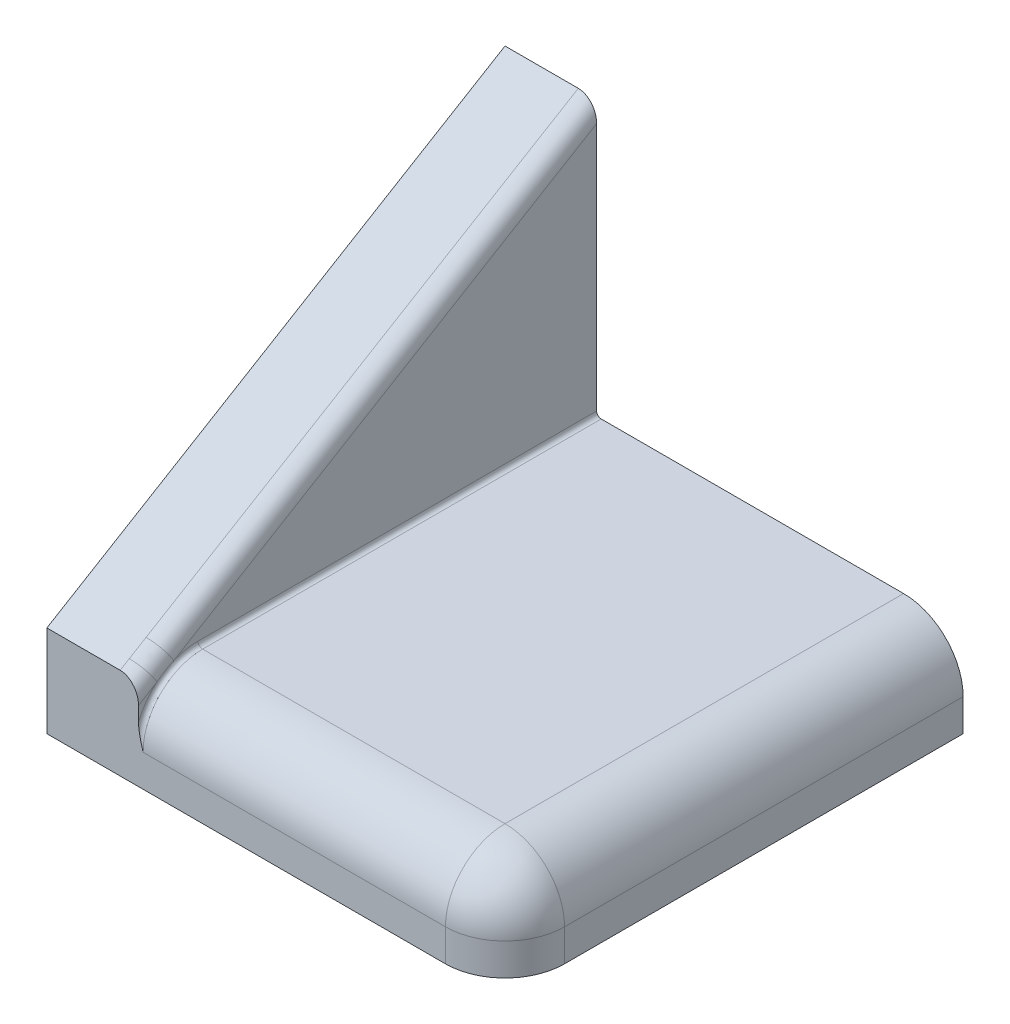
ISO-10303-21;
HEADER;
FILE_DESCRIPTION(('STEP AP214'),'2;1');
FILE_NAME('part.step','',(''),(''),'','','');
FILE_SCHEMA(('AUTOMOTIVE_DESIGN { 1 0 10303 214 1 1 1 1 }'));
ENDSEC;
DATA;
#1=APPLICATION_CONTEXT('core data for automotive mechanical design processes');
#2=APPLICATION_PROTOCOL_DEFINITION('international standard','automotive_design',2000,#1);
#3=PRODUCT_CONTEXT('',#1,'mechanical');
#4=PRODUCT('Part','Part','',(#3));
#5=PRODUCT_RELATED_PRODUCT_CATEGORY('part','',(#4));
#6=PRODUCT_DEFINITION_FORMATION('','',#4);
#7=PRODUCT_DEFINITION_CONTEXT('part definition',#1,'design');
#8=PRODUCT_DEFINITION('design','',#6,#7);
#9=PRODUCT_DEFINITION_SHAPE('','',#8);
#10=(LENGTH_UNIT() NAMED_UNIT(*) SI_UNIT(.MILLI.,.METRE.));
#11=(NAMED_UNIT(*) PLANE_ANGLE_UNIT() SI_UNIT($,.RADIAN.));
#12=(NAMED_UNIT(*) SI_UNIT($,.STERADIAN.) SOLID_ANGLE_UNIT());
#13=UNCERTAINTY_MEASURE_WITH_UNIT(LENGTH_MEASURE(1.E-05),#10,'distance_accuracy_value','');
#14=(GEOMETRIC_REPRESENTATION_CONTEXT(3) GLOBAL_UNCERTAINTY_ASSIGNED_CONTEXT((#13)) GLOBAL_UNIT_ASSIGNED_CONTEXT((#10,
#11,#12)) REPRESENTATION_CONTEXT('',''));
#15=CARTESIAN_POINT('',(0.,0.,0.));
#16=DIRECTION('',(0.,0.,1.));
#17=DIRECTION('',(1.,0.,0.));
#18=AXIS2_PLACEMENT_3D('',#15,#16,#17);
#19=CARTESIAN_POINT('',(-15.9453781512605,0.,0.));
#20=DIRECTION('',(1.,0.,0.));
#21=DIRECTION('',(0.,0.,-1.));
#22=AXIS2_PLACEMENT_3D('',#19,#20,#21);
#23=PLANE('',#22);
#24=DIRECTION('',(0.,-1.,0.));
#25=VECTOR('',#24,1.);
#26=CARTESIAN_POINT('',(-15.9453781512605,10.,-18.2773109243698));
#27=LINE('',#26,#25);
#28=CARTESIAN_POINT('',(-15.9453781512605,37.6676192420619,-18.2773109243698));
#29=VERTEX_POINT('',#28);
#30=CARTESIAN_POINT('',(-15.9453781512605,10.5,-18.2773109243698));
#31=VERTEX_POINT('',#30);
#32=EDGE_CURVE('E145',#29,#31,#27,.T.);
#33=ORIENTED_EDGE('',*,*,#32,.F.);
#34=DIRECTION('',(0.,0.514495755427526,-0.857492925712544));
#35=VECTOR('',#34,1.);
#36=CARTESIAN_POINT('',(-15.9453781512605,19.633259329,11.7799555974));
#37=LINE('',#36,#35);
#38=CARTESIAN_POINT('',(-15.9453781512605,9.98195652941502,27.865460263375));
#39=VERTEX_POINT('',#38);
#40=EDGE_CURVE('E342',#29,#39,#37,.F.);
#41=ORIENTED_EDGE('',*,*,#40,.T.);
#42=CARTESIAN_POINT('',(-15.9453781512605,3.5,25.2226890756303));
#43=DIRECTION('',(1.,0.,0.));
#44=DIRECTION('',(0.,0.,-1.));
#45=AXIS2_PLACEMENT_3D('',#42,#43,#44);
#46=CIRCLE('',#45,7.);
#47=CARTESIAN_POINT('',(-15.9453781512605,10.5,25.2226890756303));
#48=VERTEX_POINT('',#47);
#49=EDGE_CURVE('E189',#39,#48,#46,.F.);
#50=ORIENTED_EDGE('',*,*,#49,.T.);
#51=DIRECTION('',(0.,0.,1.));
#52=VECTOR('',#51,1.);
#53=CARTESIAN_POINT('',(-15.9453781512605,10.5,0.));
#54=LINE('',#53,#52);
#55=EDGE_CURVE('E186',#48,#31,#54,.F.);
#56=ORIENTED_EDGE('',*,*,#55,.T.);
#57=EDGE_LOOP('',(#33,#41,#50,#56));
#58=FACE_BOUND('',#57,.T.);
#59=ADVANCED_FACE('F37',(#58),#23,.T.);
#60=CARTESIAN_POINT('',(0.,3.5,25.2226890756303));
#61=DIRECTION('',(1.,0.,0.));
#62=DIRECTION('',(0.,0.,-1.));
#63=AXIS2_PLACEMENT_3D('',#60,#61,#62);
#64=CYLINDRICAL_SURFACE('',#63,6.5);
#65=DIRECTION('',(1.,0.,0.));
#66=VECTOR('',#65,1.);
#67=CARTESIAN_POINT('',(-25.9453781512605,3.5,31.7226890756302));
#68=LINE('',#67,#66);
#69=CARTESIAN_POINT('',(17.5546218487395,3.5,31.7226890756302));
#70=VERTEX_POINT('',#69);
#71=CARTESIAN_POINT('',(-15.4453781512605,3.5,31.7226890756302));
#72=VERTEX_POINT('',#71);
#73=EDGE_CURVE('E181',#70,#72,#68,.F.);
#74=ORIENTED_EDGE('',*,*,#73,.F.);
#75=CARTESIAN_POINT('',(17.5546218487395,3.5,25.2226890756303));
#76=DIRECTION('',(1.,0.,0.));
#77=DIRECTION('',(0.,0.,-1.));
#78=AXIS2_PLACEMENT_3D('',#75,#76,#77);
#79=CIRCLE('',#78,6.5);
#80=CARTESIAN_POINT('',(17.5546218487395,10.,25.2226890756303));
#81=VERTEX_POINT('',#80);
#82=EDGE_CURVE('E11',#70,#81,#79,.F.);
#83=ORIENTED_EDGE('',*,*,#82,.T.);
#84=DIRECTION('',(1.,0.,0.));
#85=VECTOR('',#84,1.);
#86=CARTESIAN_POINT('',(0.,10.,25.2226890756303));
#87=LINE('',#86,#85);
#88=CARTESIAN_POINT('',(-15.4453781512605,10.,25.2226890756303));
#89=VERTEX_POINT('',#88);
#90=EDGE_CURVE('E175',#89,#81,#87,.T.);
#91=ORIENTED_EDGE('',*,*,#90,.F.);
#92=CARTESIAN_POINT('',(-15.4453781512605,3.5,25.2226890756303));
#93=DIRECTION('',(1.,0.,0.));
#94=DIRECTION('',(0.,0.,-1.));
#95=AXIS2_PLACEMENT_3D('',#92,#93,#94);
#96=CIRCLE('',#95,6.5);
#97=EDGE_CURVE('E183',#89,#72,#96,.T.);
#98=ORIENTED_EDGE('',*,*,#97,.T.);
#99=EDGE_LOOP('',(#74,#83,#91,#98));
#100=FACE_BOUND('',#99,.T.);
#101=ADVANCED_FACE('F221',(#100),#64,.T.);
#102=CARTESIAN_POINT('',(-25.9453781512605,10.,-18.2773109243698));
#103=DIRECTION('',(0.,0.,-1.));
#104=DIRECTION('',(-1.,0.,0.));
#105=AXIS2_PLACEMENT_3D('',#102,#103,#104);
#106=PLANE('',#105);
#107=DIRECTION('',(1.,0.,0.));
#108=VECTOR('',#107,1.);
#109=CARTESIAN_POINT('',(-25.9453781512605,10.,-18.2773109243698));
#110=LINE('',#109,#108);
#111=CARTESIAN_POINT('',(-15.4453781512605,10.,-18.2773109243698));
#112=VERTEX_POINT('',#111);
#113=CARTESIAN_POINT('',(17.5546218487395,10.,-18.2773109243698));
#114=VERTEX_POINT('',#113);
#115=EDGE_CURVE('E160',#112,#114,#110,.T.);
#116=ORIENTED_EDGE('',*,*,#115,.T.);
#117=CARTESIAN_POINT('',(17.5546218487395,3.5,-18.2773109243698));
#118=DIRECTION('',(0.,0.,-1.));
#119=DIRECTION('',(-1.,0.,0.));
#120=AXIS2_PLACEMENT_3D('',#117,#118,#119);
#121=CIRCLE('',#120,6.5);
#122=CARTESIAN_POINT('',(24.0546218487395,3.5,-18.2773109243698));
#123=VERTEX_POINT('',#122);
#124=EDGE_CURVE('E254',#114,#123,#121,.T.);
#125=ORIENTED_EDGE('',*,*,#124,.T.);
#126=DIRECTION('',(0.,-1.,0.));
#127=VECTOR('',#126,1.);
#128=CARTESIAN_POINT('',(24.0546218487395,10.,-18.2773109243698));
#129=LINE('',#128,#127);
#130=CARTESIAN_POINT('',(24.0546218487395,0.,-18.2773109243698));
#131=VERTEX_POINT('',#130);
#132=EDGE_CURVE('E154',#123,#131,#129,.T.);
#133=ORIENTED_EDGE('',*,*,#132,.T.);
#134=DIRECTION('',(1.,0.,0.));
#135=VECTOR('',#134,1.);
#136=CARTESIAN_POINT('',(-25.9453781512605,0.,-18.2773109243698));
#137=LINE('',#136,#135);
#138=CARTESIAN_POINT('',(-25.9453781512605,0.,-18.2773109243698));
#139=VERTEX_POINT('',#138);
#140=EDGE_CURVE('E167',#139,#131,#137,.T.);
#141=ORIENTED_EDGE('',*,*,#140,.F.);
#142=DIRECTION('',(0.,-1.,0.));
#143=VECTOR('',#142,1.);
#144=CARTESIAN_POINT('',(-25.9453781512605,10.,-18.2773109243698));
#145=LINE('',#144,#143);
#146=CARTESIAN_POINT('',(-25.9453781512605,40.,-18.2773109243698));
#147=VERTEX_POINT('',#146);
#148=EDGE_CURVE('E153',#147,#139,#145,.T.);
#149=ORIENTED_EDGE('',*,*,#148,.F.);
#150=DIRECTION('',(-1.,0.,0.));
#151=VECTOR('',#150,1.);
#152=CARTESIAN_POINT('',(-15.9453781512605,40.,-18.2773109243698));
#153=LINE('',#152,#151);
#154=CARTESIAN_POINT('',(-17.9453781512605,40.,-18.2773109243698));
#155=VERTEX_POINT('',#154);
#156=EDGE_CURVE('E142',#155,#147,#153,.T.);
#157=ORIENTED_EDGE('',*,*,#156,.F.);
#158=CARTESIAN_POINT('',(-17.9453781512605,37.6676192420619,-18.2773109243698));
#159=DIRECTION('',(0.,0.,-1.));
#160=DIRECTION('',(0.,1.,0.));
#161=AXIS2_PLACEMENT_3D('',#158,#159,#160);
#162=ELLIPSE('',#161,2.33238075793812,2.);
#163=EDGE_CURVE('E338',#155,#29,#162,.T.);
#164=ORIENTED_EDGE('',*,*,#163,.T.);
#165=ORIENTED_EDGE('',*,*,#32,.T.);
#166=CARTESIAN_POINT('',(-15.4453781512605,10.5,-18.2773109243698));
#167=DIRECTION('',(0.,0.,-1.));
#168=DIRECTION('',(-1.,0.,0.));
#169=AXIS2_PLACEMENT_3D('',#166,#167,#168);
#170=CIRCLE('',#169,0.5);
#171=EDGE_CURVE('E203',#31,#112,#170,.F.);
#172=ORIENTED_EDGE('',*,*,#171,.T.);
#173=EDGE_LOOP('',(#116,#125,#133,#141,#149,#157,#164,#165,#172));
#174=FACE_BOUND('',#173,.T.);
#175=ADVANCED_FACE('F219',(#174),#106,.T.);
#176=CARTESIAN_POINT('',(-25.9453781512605,10.,-18.2773109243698));
#177=DIRECTION('',(1.,0.,0.));
#178=DIRECTION('',(0.,0.,-1.));
#179=AXIS2_PLACEMENT_3D('',#176,#177,#178);
#180=PLANE('',#179);
#181=DIRECTION('',(0.,0.,1.));
#182=VECTOR('',#181,1.);
#183=CARTESIAN_POINT('',(-25.9453781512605,0.,-18.2773109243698));
#184=LINE('',#183,#182);
#185=CARTESIAN_POINT('',(-25.9453781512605,0.,31.7226890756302));
#186=VERTEX_POINT('',#185);
#187=EDGE_CURVE('E152',#139,#186,#184,.T.);
#188=ORIENTED_EDGE('',*,*,#187,.T.);
#189=DIRECTION('',(0.,-1.,0.));
#190=VECTOR('',#189,1.);
#191=CARTESIAN_POINT('',(-25.9453781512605,10.,31.7226890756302));
#192=LINE('',#191,#190);
#193=CARTESIAN_POINT('',(-25.9453781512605,10.,31.7226890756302));
#194=VERTEX_POINT('',#193);
#195=EDGE_CURVE('E149',#194,#186,#192,.T.);
#196=ORIENTED_EDGE('',*,*,#195,.F.);
#197=DIRECTION('',(0.,0.514495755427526,-0.857492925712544));
#198=VECTOR('',#197,1.);
#199=CARTESIAN_POINT('',(-25.9453781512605,40.,-18.2773109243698));
#200=LINE('',#199,#198);
#201=EDGE_CURVE('E134',#194,#147,#200,.T.);
#202=ORIENTED_EDGE('',*,*,#201,.T.);
#203=ORIENTED_EDGE('',*,*,#148,.T.);
#204=EDGE_LOOP('',(#188,#196,#202,#203));
#205=FACE_BOUND('',#204,.T.);
#206=ADVANCED_FACE('F150',(#205),#180,.F.);
#207=CARTESIAN_POINT('',(-25.9453781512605,10.,31.7226890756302));
#208=DIRECTION('',(0.,0.,-1.));
#209=DIRECTION('',(-1.,0.,0.));
#210=AXIS2_PLACEMENT_3D('',#207,#208,#209);
#211=PLANE('',#210);
#212=DIRECTION('',(1.,0.,0.));
#213=VECTOR('',#212,1.);
#214=CARTESIAN_POINT('',(-25.9453781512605,0.,31.7226890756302));
#215=LINE('',#214,#213);
#216=CARTESIAN_POINT('',(17.5546218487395,0.,31.7226890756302));
#217=VERTEX_POINT('',#216);
#218=EDGE_CURVE('E172',#186,#217,#215,.T.);
#219=ORIENTED_EDGE('',*,*,#218,.T.);
#220=DIRECTION('',(0.,-1.,0.));
#221=VECTOR('',#220,1.);
#222=CARTESIAN_POINT('',(17.5546218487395,3.5,31.7226890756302));
#223=LINE('',#222,#221);
#224=EDGE_CURVE('E46',#217,#70,#223,.F.);
#225=ORIENTED_EDGE('',*,*,#224,.T.);
#226=ORIENTED_EDGE('',*,*,#73,.T.);
#227=CARTESIAN_POINT('',(-15.9453781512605,6.09807621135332,31.7226890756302));
#228=CARTESIAN_POINT('',(-15.9453740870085,6.05599162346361,31.7226890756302));
#229=CARTESIAN_POINT('',(-15.9446467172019,6.013913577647,31.7226890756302));
#230=CARTESIAN_POINT('',(-15.9418948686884,5.92980844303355,31.7226890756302));
#231=CARTESIAN_POINT('',(-15.9398706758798,5.88778134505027,31.7226890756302));
#232=CARTESIAN_POINT('',(-15.9320821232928,5.76189652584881,31.7226890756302));
#233=CARTESIAN_POINT('',(-15.924601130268,5.67814388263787,31.7226890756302));
#234=CARTESIAN_POINT('',(-15.9060082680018,5.51142241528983,31.7226890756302));
#235=CARTESIAN_POINT('',(-15.8949120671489,5.42845177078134,31.7226890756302));
#236=CARTESIAN_POINT('',(-15.869765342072,5.26293871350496,31.7226890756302));
#237=CARTESIAN_POINT('',(-15.8557138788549,5.18039644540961,31.7226890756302));
#238=CARTESIAN_POINT('',(-15.8157536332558,4.96457326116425,31.7226890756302));
#239=CARTESIAN_POINT('',(-15.7879044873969,4.83165427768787,31.7226890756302));
#240=CARTESIAN_POINT('',(-15.7278822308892,4.56678810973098,31.7226890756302));
#241=CARTESIAN_POINT('',(-15.6957080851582,4.43484116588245,31.7226890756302));
#242=CARTESIAN_POINT('',(-15.5950050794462,4.03971503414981,31.7226890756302));
#243=CARTESIAN_POINT('',(-15.5223697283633,3.77760145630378,31.7226890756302));
#244=CARTESIAN_POINT('',(-15.4482511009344,3.51035863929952,31.7226890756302));
#245=CARTESIAN_POINT('',(-15.4468146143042,3.50517931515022,31.7226890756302));
#246=CARTESIAN_POINT('',(-15.4453781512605,3.5,31.7226890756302));
#247=B_SPLINE_CURVE_WITH_KNOTS('',3,(#227,#228,#229,#230,#231,#232,#233,#234,#235,#236,#237,
#238,#239,#240,#241,#242,#243,#244,#245,#246),.UNSPECIFIED.,.F.,.F.,(4,2,2,2,2,2,2,2,2,4),(0.,
0.126237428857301,0.252447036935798,0.504592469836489,0.755659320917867,1.00680606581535,
1.41410363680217,1.82149885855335,2.63736410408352,2.65348861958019),.UNSPECIFIED.);
#248=CARTESIAN_POINT('',(-15.9453781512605,6.09807621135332,31.7226890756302));
#249=VERTEX_POINT('',#248);
#250=EDGE_CURVE('E195',#72,#249,#247,.F.);
#251=ORIENTED_EDGE('',*,*,#250,.T.);
#252=DIRECTION('',(0.,1.,0.));
#253=VECTOR('',#252,1.);
#254=CARTESIAN_POINT('',(-15.9453781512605,0.,31.7226890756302));
#255=LINE('',#254,#253);
#256=CARTESIAN_POINT('',(-15.9453781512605,7.66761924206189,31.7226890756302));
#257=VERTEX_POINT('',#256);
#258=EDGE_CURVE('E179',#249,#257,#255,.T.);
#259=ORIENTED_EDGE('',*,*,#258,.T.);
#260=CARTESIAN_POINT('',(-17.9453781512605,7.6676192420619,31.7226890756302));
#261=DIRECTION('',(0.,0.,-1.));
#262=DIRECTION('',(0.,1.,0.));
#263=AXIS2_PLACEMENT_3D('',#260,#261,#262);
#264=ELLIPSE('',#263,2.33238075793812,2.);
#265=CARTESIAN_POINT('',(-17.9453781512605,10.,31.7226890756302));
#266=VERTEX_POINT('',#265);
#267=EDGE_CURVE('E159',#257,#266,#264,.F.);
#268=ORIENTED_EDGE('',*,*,#267,.T.);
#269=DIRECTION('',(1.,0.,0.));
#270=VECTOR('',#269,1.);
#271=CARTESIAN_POINT('',(-25.9453781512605,10.,31.7226890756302));
#272=LINE('',#271,#270);
#273=EDGE_CURVE('E139',#194,#266,#272,.T.);
#274=ORIENTED_EDGE('',*,*,#273,.F.);
#275=ORIENTED_EDGE('',*,*,#195,.T.);
#276=EDGE_LOOP('',(#219,#225,#226,#251,#259,#268,#274,#275));
#277=FACE_BOUND('',#276,.T.);
#278=ADVANCED_FACE('F156',(#277),#211,.F.);
#279=CARTESIAN_POINT('',(24.0546218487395,10.,-18.2773109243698));
#280=DIRECTION('',(1.,0.,0.));
#281=DIRECTION('',(0.,0.,-1.));
#282=AXIS2_PLACEMENT_3D('',#279,#280,#281);
#283=PLANE('',#282);
#284=ORIENTED_EDGE('',*,*,#132,.F.);
#285=DIRECTION('',(0.,0.,1.));
#286=VECTOR('',#285,1.);
#287=CARTESIAN_POINT('',(24.0546218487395,3.5,25.2226890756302));
#288=LINE('',#287,#286);
#289=CARTESIAN_POINT('',(24.0546218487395,3.5,25.2226890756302));
#290=VERTEX_POINT('',#289);
#291=EDGE_CURVE('E258',#123,#290,#288,.T.);
#292=ORIENTED_EDGE('',*,*,#291,.T.);
#293=DIRECTION('',(0.,-1.,0.));
#294=VECTOR('',#293,1.);
#295=CARTESIAN_POINT('',(24.0546218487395,0.,25.2226890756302));
#296=LINE('',#295,#294);
#297=CARTESIAN_POINT('',(24.0546218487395,0.,25.2226890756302));
#298=VERTEX_POINT('',#297);
#299=EDGE_CURVE('E241',#290,#298,#296,.T.);
#300=ORIENTED_EDGE('',*,*,#299,.T.);
#301=DIRECTION('',(0.,0.,1.));
#302=VECTOR('',#301,1.);
#303=CARTESIAN_POINT('',(24.0546218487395,0.,-18.2773109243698));
#304=LINE('',#303,#302);
#305=EDGE_CURVE('E170',#131,#298,#304,.T.);
#306=ORIENTED_EDGE('',*,*,#305,.F.);
#307=EDGE_LOOP('',(#284,#292,#300,#306));
#308=FACE_BOUND('',#307,.T.);
#309=ADVANCED_FACE('F213',(#308),#283,.T.);
#310=CARTESIAN_POINT('',(0.,10.,0.));
#311=DIRECTION('',(0.,-1.,0.));
#312=DIRECTION('',(0.,0.,-1.));
#313=AXIS2_PLACEMENT_3D('',#310,#311,#312);
#314=PLANE('',#313);
#315=ORIENTED_EDGE('',*,*,#90,.T.);
#316=DIRECTION('',(0.,0.,1.));
#317=VECTOR('',#316,1.);
#318=CARTESIAN_POINT('',(17.5546218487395,10.,-18.2773109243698));
#319=LINE('',#318,#317);
#320=EDGE_CURVE('E256',#81,#114,#319,.F.);
#321=ORIENTED_EDGE('',*,*,#320,.T.);
#322=ORIENTED_EDGE('',*,*,#115,.F.);
#323=DIRECTION('',(0.,0.,1.));
#324=VECTOR('',#323,1.);
#325=CARTESIAN_POINT('',(-15.4453781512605,10.,0.));
#326=LINE('',#325,#324);
#327=EDGE_CURVE('E193',#112,#89,#326,.T.);
#328=ORIENTED_EDGE('',*,*,#327,.T.);
#329=EDGE_LOOP('',(#315,#321,#322,#328));
#330=FACE_BOUND('',#329,.T.);
#331=ADVANCED_FACE('F217',(#330),#314,.F.);
#332=CARTESIAN_POINT('',(0.,0.,0.));
#333=DIRECTION('',(0.,-1.,0.));
#334=DIRECTION('',(0.,0.,-1.));
#335=AXIS2_PLACEMENT_3D('',#332,#333,#334);
#336=PLANE('',#335);
#337=ORIENTED_EDGE('',*,*,#305,.T.);
#338=CARTESIAN_POINT('',(17.5546218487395,0.,25.2226890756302));
#339=DIRECTION('',(0.,-1.,0.));
#340=DIRECTION('',(0.,0.,-1.));
#341=AXIS2_PLACEMENT_3D('',#338,#339,#340);
#342=CIRCLE('',#341,6.5);
#343=EDGE_CURVE('E61',#298,#217,#342,.T.);
#344=ORIENTED_EDGE('',*,*,#343,.T.);
#345=ORIENTED_EDGE('',*,*,#218,.F.);
#346=ORIENTED_EDGE('',*,*,#187,.F.);
#347=ORIENTED_EDGE('',*,*,#140,.T.);
#348=EDGE_LOOP('',(#337,#344,#345,#346,#347));
#349=FACE_BOUND('',#348,.T.);
#350=ADVANCED_FACE('F305',(#349),#336,.T.);
#351=CARTESIAN_POINT('',(-15.9453781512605,40.,-18.2773109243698));
#352=DIRECTION('',(0.,0.857492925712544,0.514495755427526));
#353=DIRECTION('',(0.,-0.514495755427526,0.857492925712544));
#354=AXIS2_PLACEMENT_3D('',#351,#352,#353);
#355=PLANE('',#354);
#356=ORIENTED_EDGE('',*,*,#273,.T.);
#357=DIRECTION('',(0.,0.514495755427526,-0.857492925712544));
#358=VECTOR('',#357,1.);
#359=CARTESIAN_POINT('',(-17.9453781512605,40.,-18.2773109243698));
#360=LINE('',#359,#358);
#361=CARTESIAN_POINT('',(-17.9453781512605,10.5971752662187,30.7273969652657));
#362=VERTEX_POINT('',#361);
#363=EDGE_CURVE('E315',#266,#362,#360,.T.);
#364=ORIENTED_EDGE('',*,*,#363,.T.);
#365=CARTESIAN_POINT('',(-17.866395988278,12.7949777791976,27.0643927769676));
#366=CARTESIAN_POINT('',(-15.3630941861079,12.655632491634,27.296634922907));
#367=CARTESIAN_POINT('',(-15.929581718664,10.5840852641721,25.982231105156));
#368=CARTESIAN_POINT('',(-17.885503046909,12.7037693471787,27.2164068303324));
#369=CARTESIAN_POINT('',(-15.4417166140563,12.5929435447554,27.401116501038));
#370=CARTESIAN_POINT('',(-15.9334031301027,10.5532948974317,26.1300423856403));
#371=CARTESIAN_POINT('',(-17.8998237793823,12.612356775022,27.3687611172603));
#372=CARTESIAN_POINT('',(-15.512984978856,12.5231192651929,27.5174903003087));
#373=CARTESIAN_POINT('',(-15.9362672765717,10.5182556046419,26.2814075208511));
#374=CARTESIAN_POINT('',(-17.92143745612,12.4293745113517,27.6737315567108));
#375=CARTESIAN_POINT('',(-15.6386570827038,12.3748804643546,27.7645549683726));
#376=CARTESIAN_POINT('',(-15.9405900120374,10.4387284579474,26.5893197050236));
#377=CARTESIAN_POINT('',(-17.9287358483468,12.3378049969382,27.8263474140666));
#378=CARTESIAN_POINT('',(-15.6937705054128,12.2963911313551,27.8953705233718));
#379=CARTESIAN_POINT('',(-15.9420496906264,10.3942479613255,26.7458626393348));
#380=CARTESIAN_POINT('',(-17.9388669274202,12.1546995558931,28.1315231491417));
#381=CARTESIAN_POINT('',(-15.7886817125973,12.133576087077,28.1667289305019));
#382=CARTESIAN_POINT('',(-15.9440759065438,10.2948872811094,27.0622985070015));
#383=CARTESIAN_POINT('',(-17.9417035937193,12.0631636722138,28.2840829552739));
#384=CARTESIAN_POINT('',(-15.8290262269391,12.0490123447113,28.3076685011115));
#385=CARTESIAN_POINT('',(-15.9446432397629,10.240016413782,27.222188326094));
#386=CARTESIAN_POINT('',(-17.9449593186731,11.880065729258,28.5892461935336));
#387=CARTESIAN_POINT('',(-15.896387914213,11.8760446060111,28.5959480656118));
#388=CARTESIAN_POINT('',(-15.9452943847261,10.1192682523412,27.5433654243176));
#389=CARTESIAN_POINT('',(-17.9453779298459,11.7885036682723,28.7418496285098));
#390=CARTESIAN_POINT('',(-15.9237772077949,11.7872805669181,28.7438881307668));
#391=CARTESIAN_POINT('',(-15.9453781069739,10.0533889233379,27.7046529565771));
#392=CARTESIAN_POINT('',(-17.9453783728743,11.6052987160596,29.047191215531));
#393=CARTESIAN_POINT('',(-15.9667674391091,11.6074893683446,29.0435401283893));
#394=CARTESIAN_POINT('',(-15.9453781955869,9.91045986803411,28.0264122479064));
#395=CARTESIAN_POINT('',(-17.944959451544,11.5136558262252,29.199929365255));
#396=CARTESIAN_POINT('',(-15.9825942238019,11.516021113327,29.1959872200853));
#397=CARTESIAN_POINT('',(-15.9452944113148,9.83340014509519,28.1868831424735));
#398=CARTESIAN_POINT('',(-17.9442855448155,11.3303615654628,29.505419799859));
#399=CARTESIAN_POINT('',(-16.003477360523,11.3322948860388,29.5021975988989));
#400=CARTESIAN_POINT('',(-15.9451596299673,9.66861842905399,28.5044337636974));
#401=CARTESIAN_POINT('',(-17.944030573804,11.2387101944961,29.6581720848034));
#402=CARTESIAN_POINT('',(-16.0086461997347,11.2395516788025,29.6567696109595));
#403=CARTESIAN_POINT('',(-15.9451086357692,9.58089550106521,28.6615131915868));
#404=CARTESIAN_POINT('',(-17.944030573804,11.0554074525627,29.9636766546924));
#405=CARTESIAN_POINT('',(-16.0086461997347,11.0545659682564,29.9650791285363));
#406=CARTESIAN_POINT('',(-15.9451086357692,9.39585445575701,28.9699149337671));
#407=CARTESIAN_POINT('',(-17.9442855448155,10.9637560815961,30.1164289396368));
#408=CARTESIAN_POINT('',(-16.003477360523,10.96182276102,30.1196511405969));
#409=CARTESIAN_POINT('',(-15.9451596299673,9.29853633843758,29.1212372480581));
#410=CARTESIAN_POINT('',(-17.944959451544,10.7804618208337,30.4219193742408));
#411=CARTESIAN_POINT('',(-15.9825942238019,10.7780965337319,30.4258615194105));
#412=CARTESIAN_POINT('',(-15.9452944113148,9.09588895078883,29.4160684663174));
#413=CARTESIAN_POINT('',(-17.9453783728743,10.6888189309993,30.5746575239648));
#414=CARTESIAN_POINT('',(-15.9667674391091,10.6866282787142,30.5783086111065));
#415=CARTESIAN_POINT('',(-15.9453781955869,8.99056038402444,29.5595780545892));
#416=CARTESIAN_POINT('',(-17.9453779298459,10.5056139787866,30.879999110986));
#417=CARTESIAN_POINT('',(-15.9237772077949,10.5068370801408,30.877960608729));
#418=CARTESIAN_POINT('',(-15.9453781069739,8.77391585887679,29.8371080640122));
#419=CARTESIAN_POINT('',(-17.9449593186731,10.4140519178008,31.0326025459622));
#420=CARTESIAN_POINT('',(-15.896387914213,10.4180730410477,31.025900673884));
#421=CARTESIAN_POINT('',(-15.9452943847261,8.6626053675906,29.971136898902));
#422=CARTESIAN_POINT('',(-17.9417035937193,10.230953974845,31.3377657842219));
#423=CARTESIAN_POINT('',(-15.8290262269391,10.2451053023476,31.3141802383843));
#424=CARTESIAN_POINT('',(-15.9446432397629,8.43603647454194,30.2288215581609));
#425=CARTESIAN_POINT('',(-17.9388669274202,10.1394180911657,31.4903255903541));
#426=CARTESIAN_POINT('',(-15.7886817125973,10.1605415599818,31.4551198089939));
#427=CARTESIAN_POINT('',(-15.9440759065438,8.32077880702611,30.3524792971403));
#428=CARTESIAN_POINT('',(-17.9287358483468,9.95631265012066,31.7955013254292));
#429=CARTESIAN_POINT('',(-15.6937705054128,9.99772651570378,31.726478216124));
#430=CARTESIAN_POINT('',(-15.9420496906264,8.08832865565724,30.5890614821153));
#431=CARTESIAN_POINT('',(-17.92143745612,9.86474313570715,31.948117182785));
#432=CARTESIAN_POINT('',(-15.6386570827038,9.91923718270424,31.8572937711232));
#433=CARTESIAN_POINT('',(-15.9405900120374,7.97113453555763,30.7019762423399));
#434=CARTESIAN_POINT('',(-17.8998237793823,9.68176087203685,32.2530876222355));
#435=CARTESIAN_POINT('',(-15.512984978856,9.77099838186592,32.1043584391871));
#436=CARTESIAN_POINT('',(-15.9362672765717,7.73687185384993,30.9170471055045));
#437=CARTESIAN_POINT('',(-17.885503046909,9.59034829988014,32.4054419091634));
#438=CARTESIAN_POINT('',(-15.4417166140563,9.70117410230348,32.2207322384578));
#439=CARTESIAN_POINT('',(-15.9334031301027,7.61980346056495,31.0191947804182));
#440=CARTESIAN_POINT('',(-17.866395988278,9.49913986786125,32.5574559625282));
#441=CARTESIAN_POINT('',(-15.3630941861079,9.63848515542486,32.3252138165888));
#442=CARTESIAN_POINT('',(-15.929581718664,7.50387132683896,31.1159210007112));
#443=(BOUNDED_SURFACE() B_SPLINE_SURFACE(3,2,((#365,#366,#367),(#368,#369,#370),(#371,#372,
#373),(#374,#375,#376),(#377,#378,#379),(#380,#381,#382),(#383,#384,#385),(#386,#387,#388),
(#389,#390,#391),(#392,#393,#394),(#395,#396,#397),(#398,#399,#400),(#401,#402,#403),(#404,#405,
#406),(#407,#408,#409),(#410,#411,#412),(#413,#414,#415),(#416,#417,#418),(#419,#420,#421),
(#422,#423,#424),(#425,#426,#427),(#428,#429,#430),(#431,#432,#433),(#434,#435,#436),(#437,#438,
#439),(#440,#441,#442)),.UNSPECIFIED.,.F.,.F.,.F.) B_SPLINE_SURFACE_WITH_KNOTS((4,2,2,2,2,2,2,2,
2,2,2,2,4),(3,3),(0.,0.534680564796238,1.06894598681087,1.60273462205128,2.13662203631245,
2.67098978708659,3.2054044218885,3.73981905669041,4.27418680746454,4.80807422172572,
5.34186285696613,5.87612827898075,6.41080884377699),(0.,1.),
.UNSPECIFIED.) GEOMETRIC_REPRESENTATION_ITEM() RATIONAL_B_SPLINE_SURFACE(((1.,0.62197422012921,
1.),(1.,0.631952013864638,1.),(1.,0.641323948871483,1.),(1.,0.658674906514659,1.),(1.,
0.666655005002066,1.),(1.,0.681050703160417,1.),(1.,0.68746769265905,1.),(1.,0.698597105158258,
1.),(1.,0.703309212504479,1.),(1.,0.710907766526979,1.),(1.,0.713792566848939,1.),(1.,
0.717648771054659,1.),(1.,0.718620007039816,1.),(1.,0.718620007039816,1.),(1.,0.717648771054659,
1.),(1.,0.713792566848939,1.),(1.,0.710907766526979,1.),(1.,0.703309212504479,1.),(1.,
0.698597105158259,1.),(1.,0.68746769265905,1.),(1.,0.681050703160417,1.),(1.,0.666655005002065,
1.),(1.,0.658674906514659,1.),(1.,0.641323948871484,1.),(1.,0.631952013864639,1.),(1.,
0.62197422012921,1.))) REPRESENTATION_ITEM('') SURFACE());
#444=CARTESIAN_POINT('',(-17.866395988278,9.49913986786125,32.5574559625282));
#445=CARTESIAN_POINT('',(-17.885503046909,9.59034829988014,32.4054419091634));
#446=CARTESIAN_POINT('',(-17.8998237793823,9.68176087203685,32.2530876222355));
#447=CARTESIAN_POINT('',(-17.92143745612,9.86474313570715,31.948117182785));
#448=CARTESIAN_POINT('',(-17.9287358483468,9.95631265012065,31.7955013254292));
#449=CARTESIAN_POINT('',(-17.9388669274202,10.1394180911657,31.4903255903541));
#450=CARTESIAN_POINT('',(-17.9417035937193,10.230953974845,31.3377657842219));
#451=CARTESIAN_POINT('',(-17.9449593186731,10.4140519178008,31.0326025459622));
#452=CARTESIAN_POINT('',(-17.9453779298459,10.5056139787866,30.879999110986));
#453=CARTESIAN_POINT('',(-17.9453783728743,10.6888189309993,30.5746575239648));
#454=CARTESIAN_POINT('',(-17.944959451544,10.7804618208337,30.4219193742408));
#455=CARTESIAN_POINT('',(-17.9442855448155,10.9637560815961,30.1164289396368));
#456=CARTESIAN_POINT('',(-17.944030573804,11.0554074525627,29.9636766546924));
#457=CARTESIAN_POINT('',(-17.944030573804,11.2387101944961,29.6581720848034));
#458=CARTESIAN_POINT('',(-17.9442855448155,11.3303615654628,29.505419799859));
#459=CARTESIAN_POINT('',(-17.944959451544,11.5136558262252,29.199929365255));
#460=CARTESIAN_POINT('',(-17.9453783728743,11.6052987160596,29.047191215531));
#461=CARTESIAN_POINT('',(-17.9453779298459,11.7885036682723,28.7418496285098));
#462=CARTESIAN_POINT('',(-17.9449593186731,11.880065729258,28.5892461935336));
#463=CARTESIAN_POINT('',(-17.9417035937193,12.0631636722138,28.2840829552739));
#464=CARTESIAN_POINT('',(-17.9388669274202,12.1546995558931,28.1315231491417));
#465=CARTESIAN_POINT('',(-17.9287358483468,12.3378049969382,27.8263474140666));
#466=CARTESIAN_POINT('',(-17.92143745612,12.4293745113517,27.6737315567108));
#467=CARTESIAN_POINT('',(-17.8998237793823,12.612356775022,27.3687611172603));
#468=CARTESIAN_POINT('',(-17.885503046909,12.7037693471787,27.2164068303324));
#469=CARTESIAN_POINT('',(-17.866395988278,12.7949777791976,27.0643927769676));
#470=B_SPLINE_CURVE_WITH_KNOTS('',3,(#444,#445,#446,#447,#448,#449,#450,#451,#452,#453,#454,
#455,#456,#457,#458,#459,#460,#461,#462,#463,#464,#465,#466,#467,#468,#469),.UNSPECIFIED.,.F.,
.F.,(4,2,2,2,2,2,2,2,2,2,2,2,4),(0.,0.534680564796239,1.06894598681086,1.60273462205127,
2.13662203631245,2.67098978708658,3.20540442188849,3.7398190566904,4.27418680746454,
4.80807422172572,5.34186285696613,5.87612827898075,6.41080884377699),.UNSPECIFIED.);
#471=CARTESIAN_POINT('',(-17.9453781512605,11.6969423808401,28.8944517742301));
#472=VERTEX_POINT('',#471);
#473=EDGE_CURVE('E308',#362,#472,#470,.T.);
#474=ORIENTED_EDGE('',*,*,#473,.T.);
#475=DIRECTION('',(0.,0.514495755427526,-0.857492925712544));
#476=VECTOR('',#475,1.);
#477=CARTESIAN_POINT('',(-17.9453781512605,40.,-18.2773109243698));
#478=LINE('',#477,#476);
#479=EDGE_CURVE('E316',#472,#155,#478,.T.);
#480=ORIENTED_EDGE('',*,*,#479,.T.);
#481=ORIENTED_EDGE('',*,*,#156,.T.);
#482=ORIENTED_EDGE('',*,*,#201,.F.);
#483=EDGE_LOOP('',(#356,#364,#474,#480,#481,#482));
#484=FACE_BOUND('',#483,.T.);
#485=ADVANCED_FACE('F136',(#484),#355,.T.);
#486=CARTESIAN_POINT('',(-15.9453781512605,8.88218941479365,29.6984054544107));
#487=VERTEX_POINT('',#486);
#488=EDGE_CURVE('E190',#249,#487,#46,.F.);
#489=ORIENTED_EDGE('',*,*,#488,.T.);
#490=DIRECTION('',(0.,0.514495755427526,-0.857492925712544));
#491=VECTOR('',#490,1.);
#492=CARTESIAN_POINT('',(-15.9453781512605,19.633259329,11.7799555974));
#493=LINE('',#492,#491);
#494=EDGE_CURVE('E343',#487,#257,#493,.F.);
#495=ORIENTED_EDGE('',*,*,#494,.T.);
#496=ORIENTED_EDGE('',*,*,#258,.F.);
#497=EDGE_LOOP('',(#489,#495,#496));
#498=FACE_BOUND('',#497,.T.);
#499=ADVANCED_FACE('F232',(#498),#23,.T.);
#500=CARTESIAN_POINT('',(-15.4453781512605,10.5,0.));
#501=DIRECTION('',(0.,0.,1.));
#502=DIRECTION('',(1.,0.,0.));
#503=AXIS2_PLACEMENT_3D('',#500,#501,#502);
#504=CYLINDRICAL_SURFACE('',#503,0.5);
#505=ORIENTED_EDGE('',*,*,#171,.F.);
#506=ORIENTED_EDGE('',*,*,#55,.F.);
#507=CARTESIAN_POINT('',(-15.4453781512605,10.5,25.2226890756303));
#508=DIRECTION('',(0.,0.,-1.));
#509=DIRECTION('',(-1.,0.,0.));
#510=AXIS2_PLACEMENT_3D('',#507,#508,#509);
#511=CIRCLE('',#510,0.5);
#512=EDGE_CURVE('E146',#89,#48,#511,.T.);
#513=ORIENTED_EDGE('',*,*,#512,.F.);
#514=ORIENTED_EDGE('',*,*,#327,.F.);
#515=EDGE_LOOP('',(#505,#506,#513,#514));
#516=FACE_BOUND('',#515,.T.);
#517=ADVANCED_FACE('F319',(#516),#504,.F.);
#518=CARTESIAN_POINT('',(-15.4453781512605,3.5,25.2226890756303));
#519=DIRECTION('',(1.,0.,0.));
#520=DIRECTION('',(0.,0.,-1.));
#521=AXIS2_PLACEMENT_3D('',#518,#519,#520);
#522=TOROIDAL_SURFACE('',#521,7.,0.5);
#523=ORIENTED_EDGE('',*,*,#49,.F.);
#524=CARTESIAN_POINT('',(-15.929581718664,10.5840852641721,25.982231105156));
#525=CARTESIAN_POINT('',(-15.9334031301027,10.5532948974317,26.1300423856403));
#526=CARTESIAN_POINT('',(-15.9362672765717,10.5182556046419,26.2814075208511));
#527=CARTESIAN_POINT('',(-15.9405900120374,10.4387284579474,26.5893197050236));
#528=CARTESIAN_POINT('',(-15.9420496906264,10.3942479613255,26.7458626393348));
#529=CARTESIAN_POINT('',(-15.9440759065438,10.2948872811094,27.0622985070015));
#530=CARTESIAN_POINT('',(-15.9446432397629,10.240016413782,27.222188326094));
#531=CARTESIAN_POINT('',(-15.9452943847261,10.1192682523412,27.5433654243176));
#532=CARTESIAN_POINT('',(-15.9453781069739,10.0533889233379,27.7046529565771));
#533=CARTESIAN_POINT('',(-15.9453781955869,9.91045986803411,28.0264122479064));
#534=CARTESIAN_POINT('',(-15.9452944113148,9.83340014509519,28.1868831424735));
#535=CARTESIAN_POINT('',(-15.9451596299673,9.66861842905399,28.5044337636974));
#536=CARTESIAN_POINT('',(-15.9451086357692,9.58089550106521,28.6615131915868));
#537=CARTESIAN_POINT('',(-15.9451086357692,9.39585445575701,28.9699149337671));
#538=CARTESIAN_POINT('',(-15.9451596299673,9.29853633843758,29.1212372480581));
#539=CARTESIAN_POINT('',(-15.9452944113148,9.09588895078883,29.4160684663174));
#540=CARTESIAN_POINT('',(-15.9453781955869,8.99056038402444,29.5595780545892));
#541=CARTESIAN_POINT('',(-15.9453781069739,8.77391585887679,29.8371080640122));
#542=CARTESIAN_POINT('',(-15.9452943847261,8.6626053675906,29.971136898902));
#543=CARTESIAN_POINT('',(-15.9446432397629,8.43603647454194,30.2288215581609));
#544=CARTESIAN_POINT('',(-15.9440759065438,8.32077880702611,30.3524792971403));
#545=CARTESIAN_POINT('',(-15.9420496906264,8.08832865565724,30.5890614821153));
#546=CARTESIAN_POINT('',(-15.9405900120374,7.97113453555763,30.7019762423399));
#547=CARTESIAN_POINT('',(-15.9362672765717,7.73687185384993,30.9170471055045));
#548=CARTESIAN_POINT('',(-15.9334031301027,7.61980346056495,31.0191947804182));
#549=CARTESIAN_POINT('',(-15.929581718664,7.50387132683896,31.1159210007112));
#550=B_SPLINE_CURVE_WITH_KNOTS('',3,(#524,#525,#526,#527,#528,#529,#530,#531,#532,#533,#534,
#535,#536,#537,#538,#539,#540,#541,#542,#543,#544,#545,#546,#547,#548,#549),.UNSPECIFIED.,.F.,
.F.,(4,2,2,2,2,2,2,2,2,2,2,2,4),(0.,0.534680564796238,1.06894598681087,1.60273462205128,
2.13662203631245,2.67098978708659,3.2054044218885,3.73981905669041,4.27418680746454,
4.80807422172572,5.34186285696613,5.87612827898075,6.41080884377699),.UNSPECIFIED.);
#551=EDGE_CURVE('E347',#39,#487,#550,.T.);
#552=ORIENTED_EDGE('',*,*,#551,.T.);
#553=ORIENTED_EDGE('',*,*,#488,.F.);
#554=ORIENTED_EDGE('',*,*,#250,.F.);
#555=ORIENTED_EDGE('',*,*,#97,.F.);
#556=ORIENTED_EDGE('',*,*,#512,.T.);
#557=EDGE_LOOP('',(#523,#552,#553,#554,#555,#556));
#558=FACE_BOUND('',#557,.T.);
#559=ADVANCED_FACE('F205',(#558),#522,.F.);
#560=CARTESIAN_POINT('',(-17.9453781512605,38.2850141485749,-19.3063024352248));
#561=DIRECTION('',(0.,0.514495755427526,-0.857492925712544));
#562=DIRECTION('',(0.,0.857492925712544,0.514495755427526));
#563=AXIS2_PLACEMENT_3D('',#560,#561,#562);
#564=CYLINDRICAL_SURFACE('',#563,2.);
#565=ORIENTED_EDGE('',*,*,#163,.F.);
#566=ORIENTED_EDGE('',*,*,#479,.F.);
#567=CARTESIAN_POINT('',(-17.9453781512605,9.98195652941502,27.865460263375));
#568=DIRECTION('',(0.,-0.514495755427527,0.857492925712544));
#569=DIRECTION('',(0.,-0.857492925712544,-0.514495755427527));
#570=AXIS2_PLACEMENT_3D('',#567,#568,#569);
#571=CIRCLE('',#570,2.);
#572=EDGE_CURVE('E269',#39,#472,#571,.T.);
#573=ORIENTED_EDGE('',*,*,#572,.F.);
#574=ORIENTED_EDGE('',*,*,#40,.F.);
#575=EDGE_LOOP('',(#565,#566,#573,#574));
#576=FACE_BOUND('',#575,.T.);
#577=ADVANCED_FACE('F275',(#576),#564,.T.);
#578=ORIENTED_EDGE('',*,*,#572,.T.);
#579=ORIENTED_EDGE('',*,*,#473,.F.);
#580=CARTESIAN_POINT('',(-17.9453781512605,8.88218941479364,29.6984054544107));
#581=DIRECTION('',(0.,-0.514495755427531,0.857492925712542));
#582=DIRECTION('',(0.,-0.857492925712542,-0.514495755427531));
#583=AXIS2_PLACEMENT_3D('',#580,#581,#582);
#584=CIRCLE('',#583,2.);
#585=EDGE_CURVE('E245',#487,#362,#584,.T.);
#586=ORIENTED_EDGE('',*,*,#585,.F.);
#587=ORIENTED_EDGE('',*,*,#551,.F.);
#588=EDGE_LOOP('',(#578,#579,#586,#587));
#589=FACE_BOUND('',#588,.T.);
#590=ADVANCED_FACE('F278',(#589),#443,.T.);
#591=CARTESIAN_POINT('',(-17.9453781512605,38.2850141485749,-19.3063024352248));
#592=DIRECTION('',(0.,0.514495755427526,-0.857492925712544));
#593=DIRECTION('',(0.,0.857492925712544,0.514495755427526));
#594=AXIS2_PLACEMENT_3D('',#591,#592,#593);
#595=CYLINDRICAL_SURFACE('',#594,2.);
#596=ORIENTED_EDGE('',*,*,#267,.F.);
#597=ORIENTED_EDGE('',*,*,#494,.F.);
#598=ORIENTED_EDGE('',*,*,#585,.T.);
#599=ORIENTED_EDGE('',*,*,#363,.F.);
#600=EDGE_LOOP('',(#596,#597,#598,#599));
#601=FACE_BOUND('',#600,.T.);
#602=ADVANCED_FACE('F286',(#601),#595,.T.);
#603=CARTESIAN_POINT('',(17.5546218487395,10.,25.2226890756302));
#604=DIRECTION('',(0.,1.,0.));
#605=DIRECTION('',(0.,0.,1.));
#606=AXIS2_PLACEMENT_3D('',#603,#604,#605);
#607=CYLINDRICAL_SURFACE('',#606,6.5);
#608=CARTESIAN_POINT('',(17.5546218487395,3.5,25.2226890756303));
#609=DIRECTION('',(0.,1.,0.));
#610=DIRECTION('',(0.,0.,1.));
#611=AXIS2_PLACEMENT_3D('',#608,#609,#610);
#612=CIRCLE('',#611,6.5);
#613=EDGE_CURVE('E41',#70,#290,#612,.T.);
#614=ORIENTED_EDGE('',*,*,#613,.F.);
#615=ORIENTED_EDGE('',*,*,#224,.F.);
#616=ORIENTED_EDGE('',*,*,#343,.F.);
#617=ORIENTED_EDGE('',*,*,#299,.F.);
#618=EDGE_LOOP('',(#614,#615,#616,#617));
#619=FACE_BOUND('',#618,.T.);
#620=ADVANCED_FACE('F39',(#619),#607,.T.);
#621=CARTESIAN_POINT('',(17.5546218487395,3.5,25.2226890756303));
#622=DIRECTION('',(1.,0.,0.));
#623=DIRECTION('',(0.,0.,-1.));
#624=AXIS2_PLACEMENT_3D('',#621,#622,#623);
#625=SPHERICAL_SURFACE('',#624,6.5);
#626=ORIENTED_EDGE('',*,*,#82,.F.);
#627=ORIENTED_EDGE('',*,*,#613,.T.);
#628=CARTESIAN_POINT('',(17.5546218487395,3.5,25.2226890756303));
#629=DIRECTION('',(0.,0.,-1.));
#630=DIRECTION('',(-1.,0.,0.));
#631=AXIS2_PLACEMENT_3D('',#628,#629,#630);
#632=CIRCLE('',#631,6.5);
#633=EDGE_CURVE('E246',#81,#290,#632,.T.);
#634=ORIENTED_EDGE('',*,*,#633,.F.);
#635=EDGE_LOOP('',(#626,#627,#634));
#636=FACE_BOUND('',#635,.T.);
#637=ADVANCED_FACE('F247',(#636),#625,.T.);
#638=CARTESIAN_POINT('',(17.5546218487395,3.5,-18.2773109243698));
#639=DIRECTION('',(0.,0.,-1.));
#640=DIRECTION('',(-1.,0.,0.));
#641=AXIS2_PLACEMENT_3D('',#638,#639,#640);
#642=CYLINDRICAL_SURFACE('',#641,6.5);
#643=ORIENTED_EDGE('',*,*,#124,.F.);
#644=ORIENTED_EDGE('',*,*,#320,.F.);
#645=ORIENTED_EDGE('',*,*,#633,.T.);
#646=ORIENTED_EDGE('',*,*,#291,.F.);
#647=EDGE_LOOP('',(#643,#644,#645,#646));
#648=FACE_BOUND('',#647,.T.);
#649=ADVANCED_FACE('F280',(#648),#642,.T.);
#650=CLOSED_SHELL('',(#59,#101,#175,#206,#278,#309,#331,#350,#485,#499,#517,#559,#577,#590,#602,
#620,#637,#649));
#651=MANIFOLD_SOLID_BREP('B2',#650);
#652=ADVANCED_BREP_SHAPE_REPRESENTATION('',(#18,#651),#14);
#653=SHAPE_DEFINITION_REPRESENTATION(#9,#652);
ENDSEC;
END-ISO-10303-21;
